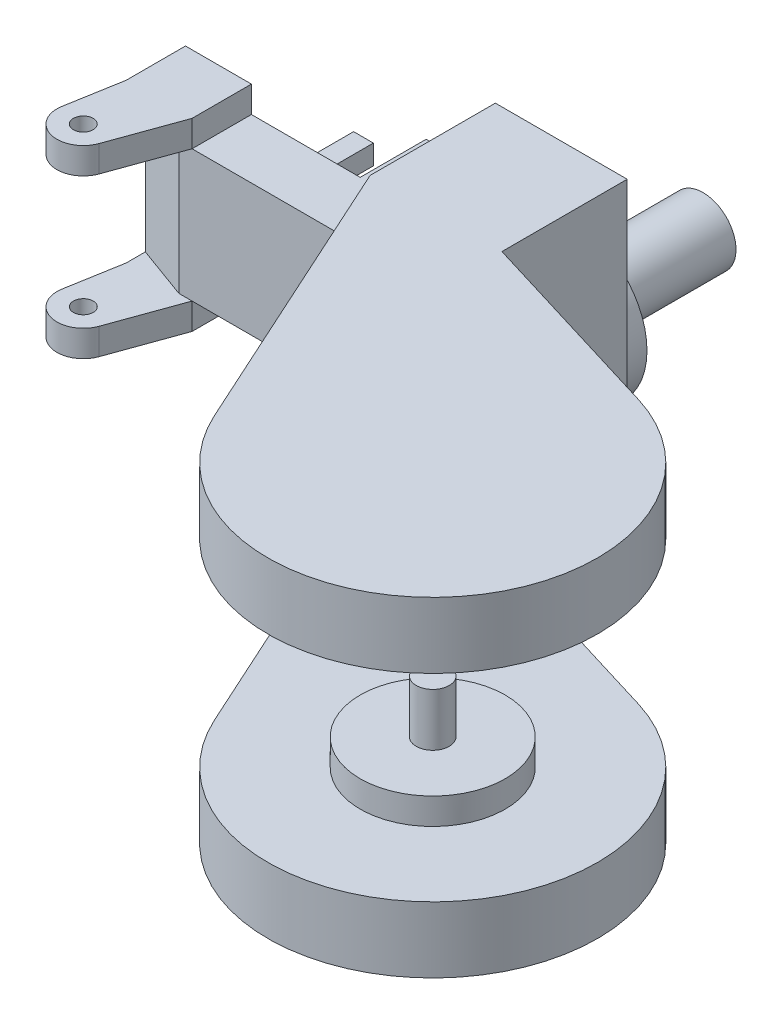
ISO-10303-21;
HEADER;
FILE_DESCRIPTION(('STEP AP214'),'2;1');
FILE_NAME('part.step','',(''),(''),'','','');
FILE_SCHEMA(('AUTOMOTIVE_DESIGN { 1 0 10303 214 1 1 1 1 }'));
ENDSEC;
DATA;
#1=APPLICATION_CONTEXT('core data for automotive mechanical design processes');
#2=APPLICATION_PROTOCOL_DEFINITION('international standard','automotive_design',2000,#1);
#3=PRODUCT_CONTEXT('',#1,'mechanical');
#4=PRODUCT('Part','Part','',(#3));
#5=PRODUCT_RELATED_PRODUCT_CATEGORY('part','',(#4));
#6=PRODUCT_DEFINITION_FORMATION('','',#4);
#7=PRODUCT_DEFINITION_CONTEXT('part definition',#1,'design');
#8=PRODUCT_DEFINITION('design','',#6,#7);
#9=PRODUCT_DEFINITION_SHAPE('','',#8);
#10=(LENGTH_UNIT() NAMED_UNIT(*) SI_UNIT(.MILLI.,.METRE.));
#11=(NAMED_UNIT(*) PLANE_ANGLE_UNIT() SI_UNIT($,.RADIAN.));
#12=(NAMED_UNIT(*) SI_UNIT($,.STERADIAN.) SOLID_ANGLE_UNIT());
#13=UNCERTAINTY_MEASURE_WITH_UNIT(LENGTH_MEASURE(1.E-05),#10,'distance_accuracy_value','');
#14=(GEOMETRIC_REPRESENTATION_CONTEXT(3) GLOBAL_UNCERTAINTY_ASSIGNED_CONTEXT((#13)) GLOBAL_UNIT_ASSIGNED_CONTEXT((#10,
#11,#12)) REPRESENTATION_CONTEXT('',''));
#15=CARTESIAN_POINT('',(0.,0.,0.));
#16=DIRECTION('',(0.,0.,1.));
#17=DIRECTION('',(1.,0.,0.));
#18=AXIS2_PLACEMENT_3D('',#15,#16,#17);
#19=CARTESIAN_POINT('',(-180.,150.,350.));
#20=DIRECTION('',(0.,0.,-1.));
#21=DIRECTION('',(-1.,0.,0.));
#22=AXIS2_PLACEMENT_3D('',#19,#20,#21);
#23=PLANE('',#22);
#24=DIRECTION('',(0.,1.,0.));
#25=VECTOR('',#24,1.);
#26=CARTESIAN_POINT('',(-445.,-50.,350.));
#27=LINE('',#26,#25);
#28=CARTESIAN_POINT('',(-445.,-90.,350.));
#29=VERTEX_POINT('',#28);
#30=CARTESIAN_POINT('',(-445.,190.,350.));
#31=VERTEX_POINT('',#30);
#32=EDGE_CURVE('E240',#29,#31,#27,.T.);
#33=ORIENTED_EDGE('',*,*,#32,.T.);
#34=DIRECTION('',(-1.,0.,0.));
#35=VECTOR('',#34,1.);
#36=CARTESIAN_POINT('',(-345.,190.,350.));
#37=LINE('',#36,#35);
#38=CARTESIAN_POINT('',(-345.,190.,350.));
#39=VERTEX_POINT('',#38);
#40=EDGE_CURVE('E164',#39,#31,#37,.T.);
#41=ORIENTED_EDGE('',*,*,#40,.F.);
#42=DIRECTION('',(0.,-1.,0.));
#43=VECTOR('',#42,1.);
#44=CARTESIAN_POINT('',(-345.,190.,350.));
#45=LINE('',#44,#43);
#46=CARTESIAN_POINT('',(-345.,150.,350.));
#47=VERTEX_POINT('',#46);
#48=EDGE_CURVE('E155',#39,#47,#45,.T.);
#49=ORIENTED_EDGE('',*,*,#48,.T.);
#50=DIRECTION('',(1.,0.,0.));
#51=VECTOR('',#50,1.);
#52=CARTESIAN_POINT('',(-445.,150.,350.));
#53=LINE('',#52,#51);
#54=CARTESIAN_POINT('',(-180.,150.,350.));
#55=VERTEX_POINT('',#54);
#56=EDGE_CURVE('E166',#47,#55,#53,.T.);
#57=ORIENTED_EDGE('',*,*,#56,.T.);
#58=DIRECTION('',(0.,-1.,0.));
#59=VECTOR('',#58,1.);
#60=CARTESIAN_POINT('',(-180.,150.,350.));
#61=LINE('',#60,#59);
#62=CARTESIAN_POINT('',(-180.,-50.,350.));
#63=VERTEX_POINT('',#62);
#64=EDGE_CURVE('E245',#55,#63,#61,.T.);
#65=ORIENTED_EDGE('',*,*,#64,.T.);
#66=DIRECTION('',(-1.,0.,0.));
#67=VECTOR('',#66,1.);
#68=CARTESIAN_POINT('',(-180.,-50.,350.));
#69=LINE('',#68,#67);
#70=CARTESIAN_POINT('',(-345.,-50.,350.));
#71=VERTEX_POINT('',#70);
#72=EDGE_CURVE('E248',#63,#71,#69,.T.);
#73=ORIENTED_EDGE('',*,*,#72,.T.);
#74=DIRECTION('',(0.,1.,0.));
#75=VECTOR('',#74,1.);
#76=CARTESIAN_POINT('',(-345.,-90.,350.));
#77=LINE('',#76,#75);
#78=CARTESIAN_POINT('',(-345.,-90.,350.));
#79=VERTEX_POINT('',#78);
#80=EDGE_CURVE('E230',#79,#71,#77,.T.);
#81=ORIENTED_EDGE('',*,*,#80,.F.);
#82=DIRECTION('',(1.,0.,0.));
#83=VECTOR('',#82,1.);
#84=CARTESIAN_POINT('',(-445.,-90.,350.));
#85=LINE('',#84,#83);
#86=EDGE_CURVE('E193',#29,#79,#85,.T.);
#87=ORIENTED_EDGE('',*,*,#86,.F.);
#88=EDGE_LOOP('',(#33,#41,#49,#57,#65,#73,#81,#87));
#89=FACE_BOUND('',#88,.T.);
#90=DIRECTION('',(1.,0.,0.));
#91=VECTOR('',#90,1.);
#92=CARTESIAN_POINT('',(-330.,55.,350.));
#93=LINE('',#92,#91);
#94=CARTESIAN_POINT('',(-340.,55.,350.));
#95=VERTEX_POINT('',#94);
#96=CARTESIAN_POINT('',(-310.,55.,350.));
#97=VERTEX_POINT('',#96);
#98=EDGE_CURVE('E112',#95,#97,#93,.T.);
#99=ORIENTED_EDGE('',*,*,#98,.F.);
#100=DIRECTION('',(0.,1.,0.));
#101=VECTOR('',#100,1.);
#102=CARTESIAN_POINT('',(-340.,65.,350.));
#103=LINE('',#102,#101);
#104=CARTESIAN_POINT('',(-340.,25.,350.));
#105=VERTEX_POINT('',#104);
#106=EDGE_CURVE('E110',#105,#95,#103,.T.);
#107=ORIENTED_EDGE('',*,*,#106,.F.);
#108=DIRECTION('',(-1.,0.,0.));
#109=VECTOR('',#108,1.);
#110=CARTESIAN_POINT('',(-330.,25.,350.));
#111=LINE('',#110,#109);
#112=CARTESIAN_POINT('',(-310.,25.,350.));
#113=VERTEX_POINT('',#112);
#114=EDGE_CURVE('E108',#113,#105,#111,.T.);
#115=ORIENTED_EDGE('',*,*,#114,.F.);
#116=DIRECTION('',(0.,-1.,0.));
#117=VECTOR('',#116,1.);
#118=CARTESIAN_POINT('',(-310.,65.,350.));
#119=LINE('',#118,#117);
#120=EDGE_CURVE('E97',#97,#113,#119,.T.);
#121=ORIENTED_EDGE('',*,*,#120,.F.);
#122=EDGE_LOOP('',(#99,#107,#115,#121));
#123=FACE_BOUND('',#122,.T.);
#124=ADVANCED_FACE('F34',(#89,#123),#23,.T.);
#125=CARTESIAN_POINT('',(0.,0.,210.));
#126=DIRECTION('',(0.,0.,-1.));
#127=DIRECTION('',(0.,1.,0.));
#128=AXIS2_PLACEMENT_3D('',#125,#126,#127);
#129=PLANE('',#128);
#130=CARTESIAN_POINT('',(0.,0.,210.));
#131=DIRECTION('',(0.,0.,-1.));
#132=DIRECTION('',(0.,1.,0.));
#133=AXIS2_PLACEMENT_3D('',#130,#131,#132);
#134=CIRCLE('',#133,115.);
#135=CARTESIAN_POINT('',(0.,115.,210.));
#136=VERTEX_POINT('',#135);
#137=EDGE_CURVE('E1134',#136,#136,#134,.T.);
#138=ORIENTED_EDGE('',*,*,#137,.T.);
#139=EDGE_LOOP('',(#138));
#140=FACE_BOUND('',#139,.T.);
#141=CARTESIAN_POINT('',(0.,0.,210.));
#142=DIRECTION('',(0.,0.,-1.));
#143=DIRECTION('',(0.,1.,0.));
#144=AXIS2_PLACEMENT_3D('',#141,#142,#143);
#145=CIRCLE('',#144,50.);
#146=CARTESIAN_POINT('',(0.,50.,210.));
#147=VERTEX_POINT('',#146);
#148=EDGE_CURVE('E118',#147,#147,#145,.T.);
#149=ORIENTED_EDGE('',*,*,#148,.F.);
#150=EDGE_LOOP('',(#149));
#151=FACE_BOUND('',#150,.T.);
#152=ADVANCED_FACE('F645',(#140,#151),#129,.T.);
#153=CARTESIAN_POINT('',(350.,110.,770.));
#154=DIRECTION('',(0.,-1.,0.));
#155=DIRECTION('',(0.,0.,-1.));
#156=AXIS2_PLACEMENT_3D('',#153,#154,#155);
#157=PLANE('',#156);
#158=CARTESIAN_POINT('',(350.,110.,770.));
#159=DIRECTION('',(0.,-1.,0.));
#160=DIRECTION('',(0.,0.,-1.));
#161=AXIS2_PLACEMENT_3D('',#158,#159,#160);
#162=CIRCLE('',#161,110.);
#163=CARTESIAN_POINT('',(350.,110.,660.));
#164=VERTEX_POINT('',#163);
#165=EDGE_CURVE('E1131',#164,#164,#162,.T.);
#166=ORIENTED_EDGE('',*,*,#165,.T.);
#167=EDGE_LOOP('',(#166));
#168=FACE_BOUND('',#167,.T.);
#169=CARTESIAN_POINT('',(350.,110.,770.));
#170=DIRECTION('',(0.,-1.,0.));
#171=DIRECTION('',(0.,0.,-1.));
#172=AXIS2_PLACEMENT_3D('',#169,#170,#171);
#173=CIRCLE('',#172,25.);
#174=CARTESIAN_POINT('',(350.,110.,745.));
#175=VERTEX_POINT('',#174);
#176=EDGE_CURVE('E1143',#175,#175,#173,.T.);
#177=ORIENTED_EDGE('',*,*,#176,.F.);
#178=EDGE_LOOP('',(#177));
#179=FACE_BOUND('',#178,.T.);
#180=ADVANCED_FACE('F651',(#168,#179),#157,.T.);
#181=CARTESIAN_POINT('',(-180.,150.,250.));
#182=DIRECTION('',(0.,0.,1.));
#183=DIRECTION('',(1.,0.,0.));
#184=AXIS2_PLACEMENT_3D('',#181,#182,#183);
#185=PLANE('',#184);
#186=DIRECTION('',(0.,1.,0.));
#187=VECTOR('',#186,1.);
#188=CARTESIAN_POINT('',(-180.,-50.,250.));
#189=LINE('',#188,#187);
#190=CARTESIAN_POINT('',(-180.,-50.,250.));
#191=VERTEX_POINT('',#190);
#192=CARTESIAN_POINT('',(-180.,150.,250.));
#193=VERTEX_POINT('',#192);
#194=EDGE_CURVE('E239',#191,#193,#189,.T.);
#195=ORIENTED_EDGE('',*,*,#194,.T.);
#196=DIRECTION('',(1.,0.,0.));
#197=VECTOR('',#196,1.);
#198=CARTESIAN_POINT('',(125.,150.,250.));
#199=LINE('',#198,#197);
#200=CARTESIAN_POINT('',(-75.,150.,250.));
#201=VERTEX_POINT('',#200);
#202=EDGE_CURVE('E276',#193,#201,#199,.T.);
#203=ORIENTED_EDGE('',*,*,#202,.T.);
#204=DIRECTION('',(0.,-1.,0.));
#205=VECTOR('',#204,1.);
#206=CARTESIAN_POINT('',(-75.,250.,250.));
#207=LINE('',#206,#205);
#208=CARTESIAN_POINT('',(-75.,250.,250.));
#209=VERTEX_POINT('',#208);
#210=EDGE_CURVE('E568',#209,#201,#207,.T.);
#211=ORIENTED_EDGE('',*,*,#210,.F.);
#212=DIRECTION('',(-1.,0.,0.));
#213=VECTOR('',#212,1.);
#214=CARTESIAN_POINT('',(125.,250.,250.));
#215=LINE('',#214,#213);
#216=CARTESIAN_POINT('',(125.,250.,250.));
#217=VERTEX_POINT('',#216);
#218=EDGE_CURVE('E553',#217,#209,#215,.T.);
#219=ORIENTED_EDGE('',*,*,#218,.F.);
#220=DIRECTION('',(0.,-1.,0.));
#221=VECTOR('',#220,1.);
#222=CARTESIAN_POINT('',(125.,150.,250.));
#223=LINE('',#222,#221);
#224=CARTESIAN_POINT('',(125.,-250.,250.));
#225=VERTEX_POINT('',#224);
#226=EDGE_CURVE('E273',#217,#225,#223,.T.);
#227=ORIENTED_EDGE('',*,*,#226,.T.);
#228=DIRECTION('',(1.,0.,0.));
#229=VECTOR('',#228,1.);
#230=CARTESIAN_POINT('',(-75.,-250.,250.));
#231=LINE('',#230,#229);
#232=CARTESIAN_POINT('',(-75.,-250.,250.));
#233=VERTEX_POINT('',#232);
#234=EDGE_CURVE('E582',#233,#225,#231,.T.);
#235=ORIENTED_EDGE('',*,*,#234,.F.);
#236=DIRECTION('',(0.,1.,0.));
#237=VECTOR('',#236,1.);
#238=CARTESIAN_POINT('',(-75.,-250.,250.));
#239=LINE('',#238,#237);
#240=CARTESIAN_POINT('',(-75.,-150.,250.));
#241=VERTEX_POINT('',#240);
#242=EDGE_CURVE('E469',#233,#241,#239,.T.);
#243=ORIENTED_EDGE('',*,*,#242,.T.);
#244=DIRECTION('',(-0.724137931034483,0.689655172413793,0.));
#245=VECTOR('',#244,1.);
#246=CARTESIAN_POINT('',(-75.,-150.,250.));
#247=LINE('',#246,#245);
#248=EDGE_CURVE('E268',#241,#191,#247,.T.);
#249=ORIENTED_EDGE('',*,*,#248,.T.);
#250=EDGE_LOOP('',(#195,#203,#211,#219,#227,#235,#243,#249));
#251=FACE_BOUND('',#250,.T.);
#252=CARTESIAN_POINT('',(0.,0.,250.));
#253=DIRECTION('',(0.,0.,1.));
#254=DIRECTION('',(1.,0.,0.));
#255=AXIS2_PLACEMENT_3D('',#252,#253,#254);
#256=CIRCLE('',#255,115.);
#257=CARTESIAN_POINT('',(115.,0.,250.));
#258=VERTEX_POINT('',#257);
#259=EDGE_CURVE('E143',#258,#258,#256,.F.);
#260=ORIENTED_EDGE('',*,*,#259,.F.);
#261=EDGE_LOOP('',(#260));
#262=FACE_BOUND('',#261,.T.);
#263=ADVANCED_FACE('F598',(#251,#262),#185,.F.);
#264=CARTESIAN_POINT('',(350.,150.,770.));
#265=DIRECTION('',(0.,1.,0.));
#266=DIRECTION('',(0.,0.,1.));
#267=AXIS2_PLACEMENT_3D('',#264,#265,#266);
#268=PLANE('',#267);
#269=DIRECTION('',(-1.,0.,0.));
#270=VECTOR('',#269,1.);
#271=CARTESIAN_POINT('',(-180.,150.,440.));
#272=LINE('',#271,#270);
#273=CARTESIAN_POINT('',(125.,150.,440.));
#274=VERTEX_POINT('',#273);
#275=CARTESIAN_POINT('',(-75.,150.,440.));
#276=VERTEX_POINT('',#275);
#277=EDGE_CURVE('E315',#274,#276,#272,.T.);
#278=ORIENTED_EDGE('',*,*,#277,.F.);
#279=DIRECTION('',(-0.956495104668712,0.,-0.291748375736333));
#280=VECTOR('',#279,1.);
#281=CARTESIAN_POINT('',(422.937093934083,150.,530.876223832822));
#282=LINE('',#281,#280);
#283=CARTESIAN_POINT('',(422.937093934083,150.,530.876223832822));
#284=VERTEX_POINT('',#283);
#285=EDGE_CURVE('E567',#284,#274,#282,.T.);
#286=ORIENTED_EDGE('',*,*,#285,.F.);
#287=CARTESIAN_POINT('',(350.,150.,770.));
#288=DIRECTION('',(0.,1.,0.));
#289=DIRECTION('',(0.,0.,1.));
#290=AXIS2_PLACEMENT_3D('',#287,#288,#289);
#291=CIRCLE('',#290,250.);
#292=CARTESIAN_POINT('',(122.484618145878,150.,873.618294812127));
#293=VERTEX_POINT('',#292);
#294=EDGE_CURVE('E563',#293,#284,#291,.T.);
#295=ORIENTED_EDGE('',*,*,#294,.F.);
#296=DIRECTION('',(0.414473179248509,0.,0.910061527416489));
#297=VECTOR('',#296,1.);
#298=CARTESIAN_POINT('',(-75.,150.,440.));
#299=LINE('',#298,#297);
#300=EDGE_CURVE('E613',#276,#293,#299,.T.);
#301=ORIENTED_EDGE('',*,*,#300,.F.);
#302=EDGE_LOOP('',(#278,#286,#295,#301));
#303=FACE_BOUND('',#302,.T.);
#304=CARTESIAN_POINT('',(350.,150.,770.));
#305=DIRECTION('',(0.,1.,0.));
#306=DIRECTION('',(0.,0.,1.));
#307=AXIS2_PLACEMENT_3D('',#304,#305,#306);
#308=CIRCLE('',#307,110.);
#309=CARTESIAN_POINT('',(350.,150.,880.));
#310=VERTEX_POINT('',#309);
#311=EDGE_CURVE('E146',#310,#310,#308,.F.);
#312=ORIENTED_EDGE('',*,*,#311,.F.);
#313=EDGE_LOOP('',(#312));
#314=FACE_BOUND('',#313,.T.);
#315=ADVANCED_FACE('F629',(#303,#314),#268,.F.);
#316=CARTESIAN_POINT('',(350.,-150.,770.));
#317=DIRECTION('',(0.,-1.,0.));
#318=DIRECTION('',(0.,0.,-1.));
#319=AXIS2_PLACEMENT_3D('',#316,#317,#318);
#320=PLANE('',#319);
#321=DIRECTION('',(0.956495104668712,0.,0.291748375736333));
#322=VECTOR('',#321,1.);
#323=CARTESIAN_POINT('',(125.,-150.,440.));
#324=LINE('',#323,#322);
#325=CARTESIAN_POINT('',(125.,-150.,440.));
#326=VERTEX_POINT('',#325);
#327=CARTESIAN_POINT('',(422.937093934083,-150.,530.876223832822));
#328=VERTEX_POINT('',#327);
#329=EDGE_CURVE('E452',#326,#328,#324,.T.);
#330=ORIENTED_EDGE('',*,*,#329,.F.);
#331=DIRECTION('',(-1.,0.,0.));
#332=VECTOR('',#331,1.);
#333=CARTESIAN_POINT('',(125.,-150.,440.));
#334=LINE('',#333,#332);
#335=CARTESIAN_POINT('',(-75.,-150.,440.));
#336=VERTEX_POINT('',#335);
#337=EDGE_CURVE('E283',#326,#336,#334,.T.);
#338=ORIENTED_EDGE('',*,*,#337,.T.);
#339=DIRECTION('',(-0.414473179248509,0.,-0.910061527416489));
#340=VECTOR('',#339,1.);
#341=CARTESIAN_POINT('',(122.484618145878,-150.,873.618294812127));
#342=LINE('',#341,#340);
#343=CARTESIAN_POINT('',(122.484618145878,-150.,873.618294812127));
#344=VERTEX_POINT('',#343);
#345=EDGE_CURVE('E450',#344,#336,#342,.T.);
#346=ORIENTED_EDGE('',*,*,#345,.F.);
#347=CARTESIAN_POINT('',(350.,-150.,770.));
#348=DIRECTION('',(0.,-1.,0.));
#349=DIRECTION('',(0.,0.,-1.));
#350=AXIS2_PLACEMENT_3D('',#347,#348,#349);
#351=CIRCLE('',#350,250.);
#352=EDGE_CURVE('E464',#328,#344,#351,.T.);
#353=ORIENTED_EDGE('',*,*,#352,.F.);
#354=EDGE_LOOP('',(#330,#338,#346,#353));
#355=FACE_BOUND('',#354,.T.);
#356=CARTESIAN_POINT('',(350.,-150.,770.));
#357=DIRECTION('',(0.,-1.,0.));
#358=DIRECTION('',(0.,0.,-1.));
#359=AXIS2_PLACEMENT_3D('',#356,#357,#358);
#360=CIRCLE('',#359,110.);
#361=CARTESIAN_POINT('',(350.,-150.,660.));
#362=VERTEX_POINT('',#361);
#363=EDGE_CURVE('E149',#362,#362,#360,.F.);
#364=ORIENTED_EDGE('',*,*,#363,.F.);
#365=EDGE_LOOP('',(#364));
#366=FACE_BOUND('',#365,.T.);
#367=ADVANCED_FACE('F447',(#355,#366),#320,.F.);
#368=CARTESIAN_POINT('',(125.,150.,440.));
#369=DIRECTION('',(0.,1.,0.));
#370=DIRECTION('',(0.,0.,1.));
#371=AXIS2_PLACEMENT_3D('',#368,#369,#370);
#372=PLANE('',#371);
#373=DIRECTION('',(1.,0.,0.));
#374=VECTOR('',#373,1.);
#375=CARTESIAN_POINT('',(125.,150.,440.));
#376=LINE('',#375,#374);
#377=CARTESIAN_POINT('',(-345.,150.,440.));
#378=VERTEX_POINT('',#377);
#379=EDGE_CURVE('E272',#378,#276,#376,.T.);
#380=ORIENTED_EDGE('',*,*,#379,.T.);
#381=DIRECTION('',(0.,0.,1.));
#382=VECTOR('',#381,1.);
#383=CARTESIAN_POINT('',(-75.,150.,250.));
#384=LINE('',#383,#382);
#385=EDGE_CURVE('E304',#201,#276,#384,.T.);
#386=ORIENTED_EDGE('',*,*,#385,.F.);
#387=ORIENTED_EDGE('',*,*,#202,.F.);
#388=DIRECTION('',(0.,0.,-1.));
#389=VECTOR('',#388,1.);
#390=CARTESIAN_POINT('',(-180.,150.,440.));
#391=LINE('',#390,#389);
#392=EDGE_CURVE('E254',#55,#193,#391,.T.);
#393=ORIENTED_EDGE('',*,*,#392,.F.);
#394=ORIENTED_EDGE('',*,*,#56,.F.);
#395=DIRECTION('',(0.,0.,-1.));
#396=VECTOR('',#395,1.);
#397=CARTESIAN_POINT('',(-345.,150.,440.));
#398=LINE('',#397,#396);
#399=EDGE_CURVE('E160',#378,#47,#398,.T.);
#400=ORIENTED_EDGE('',*,*,#399,.F.);
#401=EDGE_LOOP('',(#380,#386,#387,#393,#394,#400));
#402=FACE_BOUND('',#401,.T.);
#403=ADVANCED_FACE('F300',(#402),#372,.T.);
#404=CARTESIAN_POINT('',(-180.,-50.,440.));
#405=DIRECTION('',(0.,-1.,0.));
#406=DIRECTION('',(0.,0.,-1.));
#407=AXIS2_PLACEMENT_3D('',#404,#405,#406);
#408=PLANE('',#407);
#409=DIRECTION('',(-1.,0.,0.));
#410=VECTOR('',#409,1.);
#411=CARTESIAN_POINT('',(-180.,-50.,440.));
#412=LINE('',#411,#410);
#413=CARTESIAN_POINT('',(-180.,-50.,440.));
#414=VERTEX_POINT('',#413);
#415=CARTESIAN_POINT('',(-345.,-50.,440.));
#416=VERTEX_POINT('',#415);
#417=EDGE_CURVE('E236',#414,#416,#412,.T.);
#418=ORIENTED_EDGE('',*,*,#417,.T.);
#419=DIRECTION('',(0.,0.,1.));
#420=VECTOR('',#419,1.);
#421=CARTESIAN_POINT('',(-345.,-50.,350.));
#422=LINE('',#421,#420);
#423=EDGE_CURVE('E187',#71,#416,#422,.T.);
#424=ORIENTED_EDGE('',*,*,#423,.F.);
#425=ORIENTED_EDGE('',*,*,#72,.F.);
#426=DIRECTION('',(0.,0.,-1.));
#427=VECTOR('',#426,1.);
#428=CARTESIAN_POINT('',(-180.,-50.,440.));
#429=LINE('',#428,#427);
#430=EDGE_CURVE('E152',#414,#63,#429,.T.);
#431=ORIENTED_EDGE('',*,*,#430,.F.);
#432=EDGE_LOOP('',(#418,#424,#425,#431));
#433=FACE_BOUND('',#432,.T.);
#434=ADVANCED_FACE('F428',(#433),#408,.T.);
#435=CARTESIAN_POINT('',(-180.,-50.,440.));
#436=DIRECTION('',(-1.,0.,0.));
#437=DIRECTION('',(0.,-1.,0.));
#438=AXIS2_PLACEMENT_3D('',#435,#436,#437);
#439=PLANE('',#438);
#440=ORIENTED_EDGE('',*,*,#64,.F.);
#441=ORIENTED_EDGE('',*,*,#392,.T.);
#442=ORIENTED_EDGE('',*,*,#194,.F.);
#443=EDGE_CURVE('E264',#63,#191,#429,.T.);
#444=ORIENTED_EDGE('',*,*,#443,.F.);
#445=EDGE_LOOP('',(#440,#441,#442,#444));
#446=FACE_BOUND('',#445,.T.);
#447=ADVANCED_FACE('F665',(#446),#439,.T.);
#448=CARTESIAN_POINT('',(-75.,-150.,440.));
#449=DIRECTION('',(-0.689655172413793,-0.724137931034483,0.));
#450=DIRECTION('',(0.724137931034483,-0.689655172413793,0.));
#451=AXIS2_PLACEMENT_3D('',#448,#449,#450);
#452=PLANE('',#451);
#453=ORIENTED_EDGE('',*,*,#248,.F.);
#454=DIRECTION('',(0.,0.,-1.));
#455=VECTOR('',#454,1.);
#456=CARTESIAN_POINT('',(-75.,-150.,440.));
#457=LINE('',#456,#455);
#458=EDGE_CURVE('E258',#336,#241,#457,.T.);
#459=ORIENTED_EDGE('',*,*,#458,.F.);
#460=DIRECTION('',(-0.724137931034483,0.689655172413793,0.));
#461=VECTOR('',#460,1.);
#462=CARTESIAN_POINT('',(-75.,-150.,440.));
#463=LINE('',#462,#461);
#464=EDGE_CURVE('E259',#336,#414,#463,.T.);
#465=ORIENTED_EDGE('',*,*,#464,.T.);
#466=ORIENTED_EDGE('',*,*,#430,.T.);
#467=ORIENTED_EDGE('',*,*,#443,.T.);
#468=EDGE_LOOP('',(#453,#459,#465,#466,#467));
#469=FACE_BOUND('',#468,.T.);
#470=ADVANCED_FACE('F438',(#469),#452,.T.);
#471=CARTESIAN_POINT('',(125.,150.,440.));
#472=DIRECTION('',(1.,0.,0.));
#473=DIRECTION('',(0.,1.,0.));
#474=AXIS2_PLACEMENT_3D('',#471,#472,#473);
#475=PLANE('',#474);
#476=ORIENTED_EDGE('',*,*,#226,.F.);
#477=DIRECTION('',(0.,0.,-1.));
#478=VECTOR('',#477,1.);
#479=CARTESIAN_POINT('',(125.,250.,440.));
#480=LINE('',#479,#478);
#481=CARTESIAN_POINT('',(125.,250.,440.));
#482=VERTEX_POINT('',#481);
#483=EDGE_CURVE('E544',#482,#217,#480,.T.);
#484=ORIENTED_EDGE('',*,*,#483,.F.);
#485=DIRECTION('',(0.,-1.,0.));
#486=VECTOR('',#485,1.);
#487=CARTESIAN_POINT('',(125.,250.,440.));
#488=LINE('',#487,#486);
#489=EDGE_CURVE('E548',#482,#274,#488,.T.);
#490=ORIENTED_EDGE('',*,*,#489,.T.);
#491=DIRECTION('',(0.,-1.,0.));
#492=VECTOR('',#491,1.);
#493=CARTESIAN_POINT('',(125.,150.,440.));
#494=LINE('',#493,#492);
#495=EDGE_CURVE('E286',#274,#326,#494,.T.);
#496=ORIENTED_EDGE('',*,*,#495,.T.);
#497=DIRECTION('',(0.,1.,0.));
#498=VECTOR('',#497,1.);
#499=CARTESIAN_POINT('',(125.,-250.,440.));
#500=LINE('',#499,#498);
#501=CARTESIAN_POINT('',(125.,-250.,440.));
#502=VERTEX_POINT('',#501);
#503=EDGE_CURVE('E473',#502,#326,#500,.T.);
#504=ORIENTED_EDGE('',*,*,#503,.F.);
#505=DIRECTION('',(0.,0.,1.));
#506=VECTOR('',#505,1.);
#507=CARTESIAN_POINT('',(125.,-250.,250.));
#508=LINE('',#507,#506);
#509=EDGE_CURVE('E585',#225,#502,#508,.T.);
#510=ORIENTED_EDGE('',*,*,#509,.F.);
#511=EDGE_LOOP('',(#476,#484,#490,#496,#504,#510));
#512=FACE_BOUND('',#511,.T.);
#513=ADVANCED_FACE('F546',(#512),#475,.T.);
#514=CARTESIAN_POINT('',(-180.,150.,440.));
#515=DIRECTION('',(0.,0.,1.));
#516=DIRECTION('',(1.,0.,0.));
#517=AXIS2_PLACEMENT_3D('',#514,#515,#516);
#518=PLANE('',#517);
#519=CARTESIAN_POINT('',(-365.,150.,440.));
#520=VERTEX_POINT('',#519);
#521=EDGE_CURVE('E288',#520,#378,#376,.T.);
#522=ORIENTED_EDGE('',*,*,#521,.F.);
#523=DIRECTION('',(0.,-1.,0.));
#524=VECTOR('',#523,1.);
#525=CARTESIAN_POINT('',(-365.,150.,440.));
#526=LINE('',#525,#524);
#527=CARTESIAN_POINT('',(-365.,-50.,440.));
#528=VERTEX_POINT('',#527);
#529=EDGE_CURVE('E134',#520,#528,#526,.T.);
#530=ORIENTED_EDGE('',*,*,#529,.T.);
#531=DIRECTION('',(1.,0.,0.));
#532=VECTOR('',#531,1.);
#533=CARTESIAN_POINT('',(-180.,-50.,440.));
#534=LINE('',#533,#532);
#535=EDGE_CURVE('E233',#528,#416,#534,.T.);
#536=ORIENTED_EDGE('',*,*,#535,.T.);
#537=ORIENTED_EDGE('',*,*,#417,.F.);
#538=ORIENTED_EDGE('',*,*,#464,.F.);
#539=ORIENTED_EDGE('',*,*,#337,.F.);
#540=ORIENTED_EDGE('',*,*,#495,.F.);
#541=ORIENTED_EDGE('',*,*,#277,.T.);
#542=ORIENTED_EDGE('',*,*,#379,.F.);
#543=EDGE_LOOP('',(#522,#530,#536,#537,#538,#539,#540,#541,#542));
#544=FACE_BOUND('',#543,.T.);
#545=ADVANCED_FACE('F311',(#544),#518,.T.);
#546=CARTESIAN_POINT('',(-445.,-50.,440.));
#547=DIRECTION('',(-1.,0.,0.));
#548=DIRECTION('',(0.,0.,1.));
#549=AXIS2_PLACEMENT_3D('',#546,#547,#548);
#550=PLANE('',#549);
#551=DIRECTION('',(0.,1.,0.));
#552=VECTOR('',#551,1.);
#553=CARTESIAN_POINT('',(-445.,-50.,410.882381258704));
#554=LINE('',#553,#552);
#555=CARTESIAN_POINT('',(-445.,-50.,410.882381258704));
#556=VERTEX_POINT('',#555);
#557=CARTESIAN_POINT('',(-445.,150.,410.882381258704));
#558=VERTEX_POINT('',#557);
#559=EDGE_CURVE('E139',#556,#558,#554,.T.);
#560=ORIENTED_EDGE('',*,*,#559,.T.);
#561=DIRECTION('',(0.,0.,1.));
#562=VECTOR('',#561,1.);
#563=CARTESIAN_POINT('',(-445.,150.,530.));
#564=LINE('',#563,#562);
#565=CARTESIAN_POINT('',(-445.,150.,440.));
#566=VERTEX_POINT('',#565);
#567=EDGE_CURVE('E136',#558,#566,#564,.T.);
#568=ORIENTED_EDGE('',*,*,#567,.T.);
#569=DIRECTION('',(0.,-1.,0.));
#570=VECTOR('',#569,1.);
#571=CARTESIAN_POINT('',(-445.,190.,440.));
#572=LINE('',#571,#570);
#573=CARTESIAN_POINT('',(-445.,190.,440.));
#574=VERTEX_POINT('',#573);
#575=EDGE_CURVE('E180',#574,#566,#572,.T.);
#576=ORIENTED_EDGE('',*,*,#575,.F.);
#577=DIRECTION('',(0.,0.,1.));
#578=VECTOR('',#577,1.);
#579=CARTESIAN_POINT('',(-445.,190.,350.));
#580=LINE('',#579,#578);
#581=EDGE_CURVE('E485',#31,#574,#580,.T.);
#582=ORIENTED_EDGE('',*,*,#581,.F.);
#583=ORIENTED_EDGE('',*,*,#32,.F.);
#584=DIRECTION('',(0.,0.,-1.));
#585=VECTOR('',#584,1.);
#586=CARTESIAN_POINT('',(-445.,-90.,440.));
#587=LINE('',#586,#585);
#588=CARTESIAN_POINT('',(-445.,-90.,440.));
#589=VERTEX_POINT('',#588);
#590=EDGE_CURVE('E190',#589,#29,#587,.T.);
#591=ORIENTED_EDGE('',*,*,#590,.F.);
#592=DIRECTION('',(0.,1.,0.));
#593=VECTOR('',#592,1.);
#594=CARTESIAN_POINT('',(-445.,-90.,440.));
#595=LINE('',#594,#593);
#596=CARTESIAN_POINT('',(-445.,-50.,440.));
#597=VERTEX_POINT('',#596);
#598=EDGE_CURVE('E209',#589,#597,#595,.T.);
#599=ORIENTED_EDGE('',*,*,#598,.T.);
#600=DIRECTION('',(0.,0.,-1.));
#601=VECTOR('',#600,1.);
#602=CARTESIAN_POINT('',(-445.,-50.,530.));
#603=LINE('',#602,#601);
#604=EDGE_CURVE('E59',#597,#556,#603,.T.);
#605=ORIENTED_EDGE('',*,*,#604,.T.);
#606=EDGE_LOOP('',(#560,#568,#576,#582,#583,#591,#599,#605));
#607=FACE_BOUND('',#606,.T.);
#608=ADVANCED_FACE('F658',(#607),#550,.T.);
#609=CARTESIAN_POINT('',(-420.,-90.,530.));
#610=DIRECTION('',(0.,-1.,0.));
#611=DIRECTION('',(1.,0.,0.));
#612=AXIS2_PLACEMENT_3D('',#609,#610,#611);
#613=PLANE('',#612);
#614=ORIENTED_EDGE('',*,*,#590,.T.);
#615=ORIENTED_EDGE('',*,*,#86,.T.);
#616=DIRECTION('',(0.,0.,1.));
#617=VECTOR('',#616,1.);
#618=CARTESIAN_POINT('',(-345.,-90.,350.));
#619=LINE('',#618,#617);
#620=CARTESIAN_POINT('',(-345.,-90.,440.));
#621=VERTEX_POINT('',#620);
#622=EDGE_CURVE('E197',#79,#621,#619,.T.);
#623=ORIENTED_EDGE('',*,*,#622,.T.);
#624=DIRECTION('',(-0.339418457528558,0.,0.940635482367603));
#625=VECTOR('',#624,1.);
#626=CARTESIAN_POINT('',(-345.,-90.,440.));
#627=LINE('',#626,#625);
#628=CARTESIAN_POINT('',(-382.374580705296,-90.,543.576738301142));
#629=VERTEX_POINT('',#628);
#630=EDGE_CURVE('E200',#621,#629,#627,.T.);
#631=ORIENTED_EDGE('',*,*,#630,.T.);
#632=CARTESIAN_POINT('',(-420.,-90.,530.));
#633=DIRECTION('',(0.,-1.,0.));
#634=DIRECTION('',(1.,0.,0.));
#635=AXIS2_PLACEMENT_3D('',#632,#633,#634);
#636=CIRCLE('',#635,40.);
#637=CARTESIAN_POINT('',(-459.412604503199,-90.,523.170167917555));
#638=VERTEX_POINT('',#637);
#639=EDGE_CURVE('E203',#629,#638,#636,.T.);
#640=ORIENTED_EDGE('',*,*,#639,.T.);
#641=DIRECTION('',(0.170745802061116,0.,-0.985315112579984));
#642=VECTOR('',#641,1.);
#643=CARTESIAN_POINT('',(-459.412604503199,-90.,523.170167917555));
#644=LINE('',#643,#642);
#645=EDGE_CURVE('E206',#638,#589,#644,.T.);
#646=ORIENTED_EDGE('',*,*,#645,.T.);
#647=EDGE_LOOP('',(#614,#615,#623,#631,#640,#646));
#648=FACE_BOUND('',#647,.T.);
#649=CARTESIAN_POINT('',(-420.,-90.,530.));
#650=DIRECTION('',(0.,-1.,0.));
#651=DIRECTION('',(1.,0.,0.));
#652=AXIS2_PLACEMENT_3D('',#649,#650,#651);
#653=CIRCLE('',#652,15.);
#654=CARTESIAN_POINT('',(-405.,-90.,530.));
#655=VERTEX_POINT('',#654);
#656=EDGE_CURVE('E184',#655,#655,#653,.T.);
#657=ORIENTED_EDGE('',*,*,#656,.F.);
#658=EDGE_LOOP('',(#657));
#659=FACE_BOUND('',#658,.T.);
#660=ADVANCED_FACE('F661',(#648,#659),#613,.T.);
#661=CARTESIAN_POINT('',(-420.,-50.,530.));
#662=DIRECTION('',(0.,-1.,0.));
#663=DIRECTION('',(1.,0.,0.));
#664=AXIS2_PLACEMENT_3D('',#661,#662,#663);
#665=PLANE('',#664);
#666=ORIENTED_EDGE('',*,*,#535,.F.);
#667=DIRECTION('',(0.939692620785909,0.,0.342020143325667));
#668=VECTOR('',#667,1.);
#669=CARTESIAN_POINT('',(-384.640779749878,-50.,432.851340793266));
#670=LINE('',#669,#668);
#671=EDGE_CURVE('E43',#528,#556,#670,.F.);
#672=ORIENTED_EDGE('',*,*,#671,.T.);
#673=ORIENTED_EDGE('',*,*,#604,.F.);
#674=DIRECTION('',(0.170745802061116,0.,-0.985315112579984));
#675=VECTOR('',#674,1.);
#676=CARTESIAN_POINT('',(-459.412604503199,-50.,523.170167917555));
#677=LINE('',#676,#675);
#678=CARTESIAN_POINT('',(-459.412604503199,-50.,523.170167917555));
#679=VERTEX_POINT('',#678);
#680=EDGE_CURVE('E194',#679,#597,#677,.T.);
#681=ORIENTED_EDGE('',*,*,#680,.F.);
#682=CARTESIAN_POINT('',(-420.,-50.,530.));
#683=DIRECTION('',(0.,-1.,0.));
#684=DIRECTION('',(1.,0.,0.));
#685=AXIS2_PLACEMENT_3D('',#682,#683,#684);
#686=CIRCLE('',#685,40.);
#687=CARTESIAN_POINT('',(-382.374580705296,-50.,543.576738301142));
#688=VERTEX_POINT('',#687);
#689=EDGE_CURVE('E215',#688,#679,#686,.T.);
#690=ORIENTED_EDGE('',*,*,#689,.F.);
#691=DIRECTION('',(-0.339418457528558,0.,0.940635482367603));
#692=VECTOR('',#691,1.);
#693=CARTESIAN_POINT('',(-345.,-50.,440.));
#694=LINE('',#693,#692);
#695=EDGE_CURVE('E212',#416,#688,#694,.T.);
#696=ORIENTED_EDGE('',*,*,#695,.F.);
#697=EDGE_LOOP('',(#666,#672,#673,#681,#690,#696));
#698=FACE_BOUND('',#697,.T.);
#699=CARTESIAN_POINT('',(-420.,-50.,530.));
#700=DIRECTION('',(0.,-1.,0.));
#701=DIRECTION('',(1.,0.,0.));
#702=AXIS2_PLACEMENT_3D('',#699,#700,#701);
#703=CIRCLE('',#702,15.);
#704=CARTESIAN_POINT('',(-405.,-50.,530.));
#705=VERTEX_POINT('',#704);
#706=EDGE_CURVE('E183',#705,#705,#703,.T.);
#707=ORIENTED_EDGE('',*,*,#706,.T.);
#708=EDGE_LOOP('',(#707));
#709=FACE_BOUND('',#708,.T.);
#710=ADVANCED_FACE('F420',(#698,#709),#665,.F.);
#711=CARTESIAN_POINT('',(-345.,-90.,350.));
#712=DIRECTION('',(-1.,0.,0.));
#713=DIRECTION('',(0.,-1.,0.));
#714=AXIS2_PLACEMENT_3D('',#711,#712,#713);
#715=PLANE('',#714);
#716=ORIENTED_EDGE('',*,*,#423,.T.);
#717=DIRECTION('',(0.,1.,0.));
#718=VECTOR('',#717,1.);
#719=CARTESIAN_POINT('',(-345.,-90.,440.));
#720=LINE('',#719,#718);
#721=EDGE_CURVE('E227',#621,#416,#720,.T.);
#722=ORIENTED_EDGE('',*,*,#721,.F.);
#723=ORIENTED_EDGE('',*,*,#622,.F.);
#724=ORIENTED_EDGE('',*,*,#80,.T.);
#725=EDGE_LOOP('',(#716,#722,#723,#724));
#726=FACE_BOUND('',#725,.T.);
#727=ADVANCED_FACE('F656',(#726),#715,.F.);
#728=CARTESIAN_POINT('',(-345.,-90.,440.));
#729=DIRECTION('',(-0.940635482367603,0.,-0.339418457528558));
#730=DIRECTION('',(-0.339418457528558,0.,0.940635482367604));
#731=AXIS2_PLACEMENT_3D('',#728,#729,#730);
#732=PLANE('',#731);
#733=ORIENTED_EDGE('',*,*,#695,.T.);
#734=DIRECTION('',(0.,1.,0.));
#735=VECTOR('',#734,1.);
#736=CARTESIAN_POINT('',(-382.374580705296,-90.,543.576738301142));
#737=LINE('',#736,#735);
#738=EDGE_CURVE('E224',#629,#688,#737,.T.);
#739=ORIENTED_EDGE('',*,*,#738,.F.);
#740=ORIENTED_EDGE('',*,*,#630,.F.);
#741=ORIENTED_EDGE('',*,*,#721,.T.);
#742=EDGE_LOOP('',(#733,#739,#740,#741));
#743=FACE_BOUND('',#742,.T.);
#744=ADVANCED_FACE('F786',(#743),#732,.F.);
#745=CARTESIAN_POINT('',(-420.,-90.,530.));
#746=DIRECTION('',(0.,1.,0.));
#747=DIRECTION('',(-1.,0.,0.));
#748=AXIS2_PLACEMENT_3D('',#745,#746,#747);
#749=CYLINDRICAL_SURFACE('',#748,40.);
#750=ORIENTED_EDGE('',*,*,#689,.T.);
#751=DIRECTION('',(0.,1.,0.));
#752=VECTOR('',#751,1.);
#753=CARTESIAN_POINT('',(-459.412604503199,-90.,523.170167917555));
#754=LINE('',#753,#752);
#755=EDGE_CURVE('E221',#638,#679,#754,.T.);
#756=ORIENTED_EDGE('',*,*,#755,.F.);
#757=ORIENTED_EDGE('',*,*,#639,.F.);
#758=ORIENTED_EDGE('',*,*,#738,.T.);
#759=EDGE_LOOP('',(#750,#756,#757,#758));
#760=FACE_BOUND('',#759,.T.);
#761=ADVANCED_FACE('F783',(#760),#749,.T.);
#762=CARTESIAN_POINT('',(-459.412604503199,-90.,523.170167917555));
#763=DIRECTION('',(0.985315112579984,0.,0.170745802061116));
#764=DIRECTION('',(0.170745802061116,0.,-0.985315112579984));
#765=AXIS2_PLACEMENT_3D('',#762,#763,#764);
#766=PLANE('',#765);
#767=ORIENTED_EDGE('',*,*,#680,.T.);
#768=ORIENTED_EDGE('',*,*,#598,.F.);
#769=ORIENTED_EDGE('',*,*,#645,.F.);
#770=ORIENTED_EDGE('',*,*,#755,.T.);
#771=EDGE_LOOP('',(#767,#768,#769,#770));
#772=FACE_BOUND('',#771,.T.);
#773=ADVANCED_FACE('F774',(#772),#766,.F.);
#774=CARTESIAN_POINT('',(-420.,-90.,530.));
#775=DIRECTION('',(0.,1.,0.));
#776=DIRECTION('',(-1.,0.,0.));
#777=AXIS2_PLACEMENT_3D('',#774,#775,#776);
#778=CYLINDRICAL_SURFACE('',#777,15.);
#779=ORIENTED_EDGE('',*,*,#656,.T.);
#780=EDGE_LOOP('',(#779));
#781=FACE_BOUND('',#780,.T.);
#782=ORIENTED_EDGE('',*,*,#706,.F.);
#783=EDGE_LOOP('',(#782));
#784=FACE_BOUND('',#783,.T.);
#785=ADVANCED_FACE('F762',(#781,#784),#778,.F.);
#786=CARTESIAN_POINT('',(-420.,150.,530.));
#787=DIRECTION('',(0.,1.,0.));
#788=DIRECTION('',(0.,0.,1.));
#789=AXIS2_PLACEMENT_3D('',#786,#787,#788);
#790=PLANE('',#789);
#791=CARTESIAN_POINT('',(-420.,150.,530.));
#792=DIRECTION('',(0.,1.,0.));
#793=DIRECTION('',(0.,0.,1.));
#794=AXIS2_PLACEMENT_3D('',#791,#792,#793);
#795=CIRCLE('',#794,15.);
#796=CARTESIAN_POINT('',(-420.,150.,545.));
#797=VERTEX_POINT('',#796);
#798=EDGE_CURVE('E479',#797,#797,#795,.T.);
#799=ORIENTED_EDGE('',*,*,#798,.T.);
#800=EDGE_LOOP('',(#799));
#801=FACE_BOUND('',#800,.T.);
#802=DIRECTION('',(-0.170745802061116,0.,0.985315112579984));
#803=VECTOR('',#802,1.);
#804=CARTESIAN_POINT('',(-445.,150.,440.));
#805=LINE('',#804,#803);
#806=CARTESIAN_POINT('',(-459.412604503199,150.,523.170167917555));
#807=VERTEX_POINT('',#806);
#808=EDGE_CURVE('E347',#566,#807,#805,.T.);
#809=ORIENTED_EDGE('',*,*,#808,.F.);
#810=ORIENTED_EDGE('',*,*,#567,.F.);
#811=DIRECTION('',(-0.939692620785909,0.,-0.342020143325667));
#812=VECTOR('',#811,1.);
#813=CARTESIAN_POINT('',(-384.640779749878,150.,432.851340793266));
#814=LINE('',#813,#812);
#815=EDGE_CURVE('E131',#558,#520,#814,.F.);
#816=ORIENTED_EDGE('',*,*,#815,.T.);
#817=ORIENTED_EDGE('',*,*,#521,.T.);
#818=DIRECTION('',(0.339418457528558,0.,-0.940635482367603));
#819=VECTOR('',#818,1.);
#820=CARTESIAN_POINT('',(-382.374580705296,150.,543.576738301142));
#821=LINE('',#820,#819);
#822=CARTESIAN_POINT('',(-382.374580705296,150.,543.576738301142));
#823=VERTEX_POINT('',#822);
#824=EDGE_CURVE('E165',#823,#378,#821,.T.);
#825=ORIENTED_EDGE('',*,*,#824,.F.);
#826=CARTESIAN_POINT('',(-420.,150.,530.));
#827=DIRECTION('',(0.,1.,0.));
#828=DIRECTION('',(0.,0.,1.));
#829=AXIS2_PLACEMENT_3D('',#826,#827,#828);
#830=CIRCLE('',#829,40.);
#831=EDGE_CURVE('E328',#807,#823,#830,.T.);
#832=ORIENTED_EDGE('',*,*,#831,.F.);
#833=EDGE_LOOP('',(#809,#810,#816,#817,#825,#832));
#834=FACE_BOUND('',#833,.T.);
#835=ADVANCED_FACE('F358',(#801,#834),#790,.F.);
#836=CARTESIAN_POINT('',(-420.,190.,530.));
#837=DIRECTION('',(0.,1.,0.));
#838=DIRECTION('',(0.,0.,1.));
#839=AXIS2_PLACEMENT_3D('',#836,#837,#838);
#840=PLANE('',#839);
#841=ORIENTED_EDGE('',*,*,#40,.T.);
#842=ORIENTED_EDGE('',*,*,#581,.T.);
#843=DIRECTION('',(-0.170745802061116,0.,0.985315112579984));
#844=VECTOR('',#843,1.);
#845=CARTESIAN_POINT('',(-445.,190.,440.));
#846=LINE('',#845,#844);
#847=CARTESIAN_POINT('',(-459.412604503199,190.,523.170167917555));
#848=VERTEX_POINT('',#847);
#849=EDGE_CURVE('E488',#574,#848,#846,.T.);
#850=ORIENTED_EDGE('',*,*,#849,.T.);
#851=CARTESIAN_POINT('',(-420.,190.,530.));
#852=DIRECTION('',(0.,1.,0.));
#853=DIRECTION('',(0.,0.,1.));
#854=AXIS2_PLACEMENT_3D('',#851,#852,#853);
#855=CIRCLE('',#854,40.);
#856=CARTESIAN_POINT('',(-382.374580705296,190.,543.576738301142));
#857=VERTEX_POINT('',#856);
#858=EDGE_CURVE('E343',#848,#857,#855,.T.);
#859=ORIENTED_EDGE('',*,*,#858,.T.);
#860=DIRECTION('',(0.339418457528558,0.,-0.940635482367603));
#861=VECTOR('',#860,1.);
#862=CARTESIAN_POINT('',(-382.374580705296,190.,543.576738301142));
#863=LINE('',#862,#861);
#864=CARTESIAN_POINT('',(-345.,190.,440.));
#865=VERTEX_POINT('',#864);
#866=EDGE_CURVE('E341',#857,#865,#863,.T.);
#867=ORIENTED_EDGE('',*,*,#866,.T.);
#868=DIRECTION('',(0.,0.,-1.));
#869=VECTOR('',#868,1.);
#870=CARTESIAN_POINT('',(-345.,190.,440.));
#871=LINE('',#870,#869);
#872=EDGE_CURVE('E159',#865,#39,#871,.T.);
#873=ORIENTED_EDGE('',*,*,#872,.T.);
#874=EDGE_LOOP('',(#841,#842,#850,#859,#867,#873));
#875=FACE_BOUND('',#874,.T.);
#876=CARTESIAN_POINT('',(-420.,190.,530.));
#877=DIRECTION('',(0.,1.,0.));
#878=DIRECTION('',(0.,0.,1.));
#879=AXIS2_PLACEMENT_3D('',#876,#877,#878);
#880=CIRCLE('',#879,15.);
#881=CARTESIAN_POINT('',(-420.,190.,545.));
#882=VERTEX_POINT('',#881);
#883=EDGE_CURVE('E349',#882,#882,#880,.T.);
#884=ORIENTED_EDGE('',*,*,#883,.F.);
#885=EDGE_LOOP('',(#884));
#886=FACE_BOUND('',#885,.T.);
#887=ADVANCED_FACE('F491',(#875,#886),#840,.T.);
#888=CARTESIAN_POINT('',(-445.,190.,440.));
#889=DIRECTION('',(0.985315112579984,0.,0.170745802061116));
#890=DIRECTION('',(0.170745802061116,0.,-0.985315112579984));
#891=AXIS2_PLACEMENT_3D('',#888,#889,#890);
#892=PLANE('',#891);
#893=ORIENTED_EDGE('',*,*,#808,.T.);
#894=DIRECTION('',(0.,-1.,0.));
#895=VECTOR('',#894,1.);
#896=CARTESIAN_POINT('',(-459.412604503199,190.,523.170167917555));
#897=LINE('',#896,#895);
#898=EDGE_CURVE('E177',#848,#807,#897,.T.);
#899=ORIENTED_EDGE('',*,*,#898,.F.);
#900=ORIENTED_EDGE('',*,*,#849,.F.);
#901=ORIENTED_EDGE('',*,*,#575,.T.);
#902=EDGE_LOOP('',(#893,#899,#900,#901));
#903=FACE_BOUND('',#902,.T.);
#904=ADVANCED_FACE('F759',(#903),#892,.F.);
#905=CARTESIAN_POINT('',(-420.,190.,530.));
#906=DIRECTION('',(0.,-1.,0.));
#907=DIRECTION('',(0.,0.,-1.));
#908=AXIS2_PLACEMENT_3D('',#905,#906,#907);
#909=CYLINDRICAL_SURFACE('',#908,40.);
#910=ORIENTED_EDGE('',*,*,#831,.T.);
#911=DIRECTION('',(0.,-1.,0.));
#912=VECTOR('',#911,1.);
#913=CARTESIAN_POINT('',(-382.374580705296,190.,543.576738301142));
#914=LINE('',#913,#912);
#915=EDGE_CURVE('E174',#857,#823,#914,.T.);
#916=ORIENTED_EDGE('',*,*,#915,.F.);
#917=ORIENTED_EDGE('',*,*,#858,.F.);
#918=ORIENTED_EDGE('',*,*,#898,.T.);
#919=EDGE_LOOP('',(#910,#916,#917,#918));
#920=FACE_BOUND('',#919,.T.);
#921=ADVANCED_FACE('F352',(#920),#909,.T.);
#922=CARTESIAN_POINT('',(-382.374580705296,190.,543.576738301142));
#923=DIRECTION('',(-0.940635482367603,0.,-0.339418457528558));
#924=DIRECTION('',(-0.339418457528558,0.,0.940635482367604));
#925=AXIS2_PLACEMENT_3D('',#922,#923,#924);
#926=PLANE('',#925);
#927=ORIENTED_EDGE('',*,*,#824,.T.);
#928=DIRECTION('',(0.,-1.,0.));
#929=VECTOR('',#928,1.);
#930=CARTESIAN_POINT('',(-345.,190.,440.));
#931=LINE('',#930,#929);
#932=EDGE_CURVE('E158',#865,#378,#931,.T.);
#933=ORIENTED_EDGE('',*,*,#932,.F.);
#934=ORIENTED_EDGE('',*,*,#866,.F.);
#935=ORIENTED_EDGE('',*,*,#915,.T.);
#936=EDGE_LOOP('',(#927,#933,#934,#935));
#937=FACE_BOUND('',#936,.T.);
#938=ADVANCED_FACE('F321',(#937),#926,.F.);
#939=CARTESIAN_POINT('',(-345.,190.,440.));
#940=DIRECTION('',(-1.,0.,0.));
#941=DIRECTION('',(0.,0.,1.));
#942=AXIS2_PLACEMENT_3D('',#939,#940,#941);
#943=PLANE('',#942);
#944=ORIENTED_EDGE('',*,*,#399,.T.);
#945=ORIENTED_EDGE('',*,*,#48,.F.);
#946=ORIENTED_EDGE('',*,*,#872,.F.);
#947=ORIENTED_EDGE('',*,*,#932,.T.);
#948=EDGE_LOOP('',(#944,#945,#946,#947));
#949=FACE_BOUND('',#948,.T.);
#950=ADVANCED_FACE('F330',(#949),#943,.F.);
#951=CARTESIAN_POINT('',(-420.,190.,530.));
#952=DIRECTION('',(0.,-1.,0.));
#953=DIRECTION('',(0.,0.,-1.));
#954=AXIS2_PLACEMENT_3D('',#951,#952,#953);
#955=CYLINDRICAL_SURFACE('',#954,15.);
#956=ORIENTED_EDGE('',*,*,#883,.T.);
#957=EDGE_LOOP('',(#956));
#958=FACE_BOUND('',#957,.T.);
#959=ORIENTED_EDGE('',*,*,#798,.F.);
#960=EDGE_LOOP('',(#959));
#961=FACE_BOUND('',#960,.T.);
#962=ADVANCED_FACE('F753',(#958,#961),#955,.F.);
#963=CARTESIAN_POINT('',(125.,-250.,440.));
#964=DIRECTION('',(-0.291748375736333,0.,0.956495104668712));
#965=DIRECTION('',(0.956495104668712,0.,0.291748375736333));
#966=AXIS2_PLACEMENT_3D('',#963,#964,#965);
#967=PLANE('',#966);
#968=ORIENTED_EDGE('',*,*,#329,.T.);
#969=DIRECTION('',(0.,1.,0.));
#970=VECTOR('',#969,1.);
#971=CARTESIAN_POINT('',(422.937093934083,-250.,530.876223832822));
#972=LINE('',#971,#970);
#973=CARTESIAN_POINT('',(422.937093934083,-250.,530.876223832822));
#974=VERTEX_POINT('',#973);
#975=EDGE_CURVE('E471',#974,#328,#972,.T.);
#976=ORIENTED_EDGE('',*,*,#975,.F.);
#977=DIRECTION('',(0.956495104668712,0.,0.291748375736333));
#978=VECTOR('',#977,1.);
#979=CARTESIAN_POINT('',(125.,-250.,440.));
#980=LINE('',#979,#978);
#981=EDGE_CURVE('E463',#502,#974,#980,.T.);
#982=ORIENTED_EDGE('',*,*,#981,.F.);
#983=ORIENTED_EDGE('',*,*,#503,.T.);
#984=EDGE_LOOP('',(#968,#976,#982,#983));
#985=FACE_BOUND('',#984,.T.);
#986=ADVANCED_FACE('F592',(#985),#967,.F.);
#987=CARTESIAN_POINT('',(350.,-250.,770.));
#988=DIRECTION('',(0.,1.,0.));
#989=DIRECTION('',(0.,0.,1.));
#990=AXIS2_PLACEMENT_3D('',#987,#988,#989);
#991=CYLINDRICAL_SURFACE('',#990,250.);
#992=ORIENTED_EDGE('',*,*,#352,.T.);
#993=DIRECTION('',(0.,1.,0.));
#994=VECTOR('',#993,1.);
#995=CARTESIAN_POINT('',(122.484618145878,-250.,873.618294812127));
#996=LINE('',#995,#994);
#997=CARTESIAN_POINT('',(122.484618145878,-250.,873.618294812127));
#998=VERTEX_POINT('',#997);
#999=EDGE_CURVE('E462',#998,#344,#996,.T.);
#1000=ORIENTED_EDGE('',*,*,#999,.F.);
#1001=CARTESIAN_POINT('',(350.,-250.,770.));
#1002=DIRECTION('',(0.,-1.,0.));
#1003=DIRECTION('',(0.,0.,-1.));
#1004=AXIS2_PLACEMENT_3D('',#1001,#1002,#1003);
#1005=CIRCLE('',#1004,250.);
#1006=EDGE_CURVE('E577',#974,#998,#1005,.T.);
#1007=ORIENTED_EDGE('',*,*,#1006,.F.);
#1008=ORIENTED_EDGE('',*,*,#975,.T.);
#1009=EDGE_LOOP('',(#992,#1000,#1007,#1008));
#1010=FACE_BOUND('',#1009,.T.);
#1011=ADVANCED_FACE('F747',(#1010),#991,.T.);
#1012=CARTESIAN_POINT('',(122.484618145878,-250.,873.618294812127));
#1013=DIRECTION('',(0.910061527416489,0.,-0.414473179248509));
#1014=DIRECTION('',(-0.414473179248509,0.,-0.910061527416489));
#1015=AXIS2_PLACEMENT_3D('',#1012,#1013,#1014);
#1016=PLANE('',#1015);
#1017=ORIENTED_EDGE('',*,*,#345,.T.);
#1018=DIRECTION('',(0.,1.,0.));
#1019=VECTOR('',#1018,1.);
#1020=CARTESIAN_POINT('',(-75.,-250.,440.));
#1021=LINE('',#1020,#1019);
#1022=CARTESIAN_POINT('',(-75.,-250.,440.));
#1023=VERTEX_POINT('',#1022);
#1024=EDGE_CURVE('E459',#1023,#336,#1021,.T.);
#1025=ORIENTED_EDGE('',*,*,#1024,.F.);
#1026=DIRECTION('',(-0.414473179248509,0.,-0.910061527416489));
#1027=VECTOR('',#1026,1.);
#1028=CARTESIAN_POINT('',(122.484618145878,-250.,873.618294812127));
#1029=LINE('',#1028,#1027);
#1030=EDGE_CURVE('E579',#998,#1023,#1029,.T.);
#1031=ORIENTED_EDGE('',*,*,#1030,.F.);
#1032=ORIENTED_EDGE('',*,*,#999,.T.);
#1033=EDGE_LOOP('',(#1017,#1025,#1031,#1032));
#1034=FACE_BOUND('',#1033,.T.);
#1035=ADVANCED_FACE('F456',(#1034),#1016,.F.);
#1036=CARTESIAN_POINT('',(-75.,-250.,440.));
#1037=DIRECTION('',(1.,0.,0.));
#1038=DIRECTION('',(0.,1.,0.));
#1039=AXIS2_PLACEMENT_3D('',#1036,#1037,#1038);
#1040=PLANE('',#1039);
#1041=ORIENTED_EDGE('',*,*,#458,.T.);
#1042=ORIENTED_EDGE('',*,*,#242,.F.);
#1043=DIRECTION('',(0.,0.,-1.));
#1044=VECTOR('',#1043,1.);
#1045=CARTESIAN_POINT('',(-75.,-250.,440.));
#1046=LINE('',#1045,#1044);
#1047=EDGE_CURVE('E468',#1023,#233,#1046,.T.);
#1048=ORIENTED_EDGE('',*,*,#1047,.F.);
#1049=ORIENTED_EDGE('',*,*,#1024,.T.);
#1050=EDGE_LOOP('',(#1041,#1042,#1048,#1049));
#1051=FACE_BOUND('',#1050,.T.);
#1052=ADVANCED_FACE('F466',(#1051),#1040,.F.);
#1053=CARTESIAN_POINT('',(350.,-250.,770.));
#1054=DIRECTION('',(0.,-1.,0.));
#1055=DIRECTION('',(0.,0.,-1.));
#1056=AXIS2_PLACEMENT_3D('',#1053,#1054,#1055);
#1057=PLANE('',#1056);
#1058=ORIENTED_EDGE('',*,*,#981,.T.);
#1059=ORIENTED_EDGE('',*,*,#1006,.T.);
#1060=ORIENTED_EDGE('',*,*,#1030,.T.);
#1061=ORIENTED_EDGE('',*,*,#1047,.T.);
#1062=ORIENTED_EDGE('',*,*,#234,.T.);
#1063=ORIENTED_EDGE('',*,*,#509,.T.);
#1064=EDGE_LOOP('',(#1058,#1059,#1060,#1061,#1062,#1063));
#1065=FACE_BOUND('',#1064,.T.);
#1066=ADVANCED_FACE('F595',(#1065),#1057,.T.);
#1067=CARTESIAN_POINT('',(422.937093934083,250.,530.876223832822));
#1068=DIRECTION('',(-0.291748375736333,0.,0.956495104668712));
#1069=DIRECTION('',(0.956495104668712,0.,0.291748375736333));
#1070=AXIS2_PLACEMENT_3D('',#1067,#1068,#1069);
#1071=PLANE('',#1070);
#1072=ORIENTED_EDGE('',*,*,#285,.T.);
#1073=ORIENTED_EDGE('',*,*,#489,.F.);
#1074=DIRECTION('',(-0.956495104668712,0.,-0.291748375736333));
#1075=VECTOR('',#1074,1.);
#1076=CARTESIAN_POINT('',(422.937093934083,250.,530.876223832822));
#1077=LINE('',#1076,#1075);
#1078=CARTESIAN_POINT('',(422.937093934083,250.,530.876223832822));
#1079=VERTEX_POINT('',#1078);
#1080=EDGE_CURVE('E554',#1079,#482,#1077,.T.);
#1081=ORIENTED_EDGE('',*,*,#1080,.F.);
#1082=DIRECTION('',(0.,-1.,0.));
#1083=VECTOR('',#1082,1.);
#1084=CARTESIAN_POINT('',(422.937093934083,250.,530.876223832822));
#1085=LINE('',#1084,#1083);
#1086=EDGE_CURVE('E609',#1079,#284,#1085,.T.);
#1087=ORIENTED_EDGE('',*,*,#1086,.T.);
#1088=EDGE_LOOP('',(#1072,#1073,#1081,#1087));
#1089=FACE_BOUND('',#1088,.T.);
#1090=ADVANCED_FACE('F565',(#1089),#1071,.F.);
#1091=CARTESIAN_POINT('',(-75.,250.,250.));
#1092=DIRECTION('',(1.,0.,0.));
#1093=DIRECTION('',(0.,0.,-1.));
#1094=AXIS2_PLACEMENT_3D('',#1091,#1092,#1093);
#1095=PLANE('',#1094);
#1096=ORIENTED_EDGE('',*,*,#385,.T.);
#1097=DIRECTION('',(0.,-1.,0.));
#1098=VECTOR('',#1097,1.);
#1099=CARTESIAN_POINT('',(-75.,250.,440.));
#1100=LINE('',#1099,#1098);
#1101=CARTESIAN_POINT('',(-75.,250.,440.));
#1102=VERTEX_POINT('',#1101);
#1103=EDGE_CURVE('E571',#1102,#276,#1100,.T.);
#1104=ORIENTED_EDGE('',*,*,#1103,.F.);
#1105=DIRECTION('',(0.,0.,1.));
#1106=VECTOR('',#1105,1.);
#1107=CARTESIAN_POINT('',(-75.,250.,250.));
#1108=LINE('',#1107,#1106);
#1109=EDGE_CURVE('E602',#209,#1102,#1108,.T.);
#1110=ORIENTED_EDGE('',*,*,#1109,.F.);
#1111=ORIENTED_EDGE('',*,*,#210,.T.);
#1112=EDGE_LOOP('',(#1096,#1104,#1110,#1111));
#1113=FACE_BOUND('',#1112,.T.);
#1114=ADVANCED_FACE('F641',(#1113),#1095,.F.);
#1115=CARTESIAN_POINT('',(-75.,250.,440.));
#1116=DIRECTION('',(0.910061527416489,0.,-0.414473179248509));
#1117=DIRECTION('',(-0.414473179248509,0.,-0.910061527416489));
#1118=AXIS2_PLACEMENT_3D('',#1115,#1116,#1117);
#1119=PLANE('',#1118);
#1120=ORIENTED_EDGE('',*,*,#300,.T.);
#1121=DIRECTION('',(0.,-1.,0.));
#1122=VECTOR('',#1121,1.);
#1123=CARTESIAN_POINT('',(122.484618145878,250.,873.618294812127));
#1124=LINE('',#1123,#1122);
#1125=CARTESIAN_POINT('',(122.484618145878,250.,873.618294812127));
#1126=VERTEX_POINT('',#1125);
#1127=EDGE_CURVE('E617',#1126,#293,#1124,.T.);
#1128=ORIENTED_EDGE('',*,*,#1127,.F.);
#1129=DIRECTION('',(0.414473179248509,0.,0.910061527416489));
#1130=VECTOR('',#1129,1.);
#1131=CARTESIAN_POINT('',(-75.,250.,440.));
#1132=LINE('',#1131,#1130);
#1133=EDGE_CURVE('E604',#1102,#1126,#1132,.T.);
#1134=ORIENTED_EDGE('',*,*,#1133,.F.);
#1135=ORIENTED_EDGE('',*,*,#1103,.T.);
#1136=EDGE_LOOP('',(#1120,#1128,#1134,#1135));
#1137=FACE_BOUND('',#1136,.T.);
#1138=ADVANCED_FACE('F624',(#1137),#1119,.F.);
#1139=CARTESIAN_POINT('',(350.,250.,770.));
#1140=DIRECTION('',(0.,-1.,0.));
#1141=DIRECTION('',(0.,0.,-1.));
#1142=AXIS2_PLACEMENT_3D('',#1139,#1140,#1141);
#1143=CYLINDRICAL_SURFACE('',#1142,250.);
#1144=ORIENTED_EDGE('',*,*,#294,.T.);
#1145=ORIENTED_EDGE('',*,*,#1086,.F.);
#1146=CARTESIAN_POINT('',(350.,250.,770.));
#1147=DIRECTION('',(0.,1.,0.));
#1148=DIRECTION('',(0.,0.,1.));
#1149=AXIS2_PLACEMENT_3D('',#1146,#1147,#1148);
#1150=CIRCLE('',#1149,250.);
#1151=EDGE_CURVE('E559',#1126,#1079,#1150,.T.);
#1152=ORIENTED_EDGE('',*,*,#1151,.F.);
#1153=ORIENTED_EDGE('',*,*,#1127,.T.);
#1154=EDGE_LOOP('',(#1144,#1145,#1152,#1153));
#1155=FACE_BOUND('',#1154,.T.);
#1156=ADVANCED_FACE('F632',(#1155),#1143,.T.);
#1157=CARTESIAN_POINT('',(350.,250.,770.));
#1158=DIRECTION('',(0.,1.,0.));
#1159=DIRECTION('',(0.,0.,1.));
#1160=AXIS2_PLACEMENT_3D('',#1157,#1158,#1159);
#1161=PLANE('',#1160);
#1162=ORIENTED_EDGE('',*,*,#1080,.T.);
#1163=ORIENTED_EDGE('',*,*,#483,.T.);
#1164=ORIENTED_EDGE('',*,*,#218,.T.);
#1165=ORIENTED_EDGE('',*,*,#1109,.T.);
#1166=ORIENTED_EDGE('',*,*,#1133,.T.);
#1167=ORIENTED_EDGE('',*,*,#1151,.T.);
#1168=EDGE_LOOP('',(#1162,#1163,#1164,#1165,#1166,#1167));
#1169=FACE_BOUND('',#1168,.T.);
#1170=ADVANCED_FACE('F557',(#1169),#1161,.T.);
#1171=CARTESIAN_POINT('',(350.,-110.,770.));
#1172=DIRECTION('',(0.,-1.,0.));
#1173=DIRECTION('',(0.,0.,-1.));
#1174=AXIS2_PLACEMENT_3D('',#1171,#1172,#1173);
#1175=CYLINDRICAL_SURFACE('',#1174,110.);
#1176=CARTESIAN_POINT('',(350.,-110.,770.));
#1177=DIRECTION('',(0.,1.,0.));
#1178=DIRECTION('',(0.,0.,1.));
#1179=AXIS2_PLACEMENT_3D('',#1176,#1177,#1178);
#1180=CIRCLE('',#1179,110.);
#1181=CARTESIAN_POINT('',(350.,-110.,880.));
#1182=VERTEX_POINT('',#1181);
#1183=EDGE_CURVE('E611',#1182,#1182,#1180,.T.);
#1184=ORIENTED_EDGE('',*,*,#1183,.F.);
#1185=EDGE_LOOP('',(#1184));
#1186=FACE_BOUND('',#1185,.T.);
#1187=ORIENTED_EDGE('',*,*,#363,.T.);
#1188=EDGE_LOOP('',(#1187));
#1189=FACE_BOUND('',#1188,.T.);
#1190=ADVANCED_FACE('F639',(#1186,#1189),#1175,.T.);
#1191=CARTESIAN_POINT('',(350.,-110.,770.));
#1192=DIRECTION('',(0.,1.,0.));
#1193=DIRECTION('',(0.,0.,1.));
#1194=AXIS2_PLACEMENT_3D('',#1191,#1192,#1193);
#1195=PLANE('',#1194);
#1196=CARTESIAN_POINT('',(350.,-110.,770.));
#1197=DIRECTION('',(0.,1.,0.));
#1198=DIRECTION('',(0.,0.,1.));
#1199=AXIS2_PLACEMENT_3D('',#1196,#1197,#1198);
#1200=CIRCLE('',#1199,25.);
#1201=CARTESIAN_POINT('',(350.,-110.,795.));
#1202=VERTEX_POINT('',#1201);
#1203=EDGE_CURVE('E12',#1202,#1202,#1200,.T.);
#1204=ORIENTED_EDGE('',*,*,#1203,.F.);
#1205=EDGE_LOOP('',(#1204));
#1206=FACE_BOUND('',#1205,.T.);
#1207=ORIENTED_EDGE('',*,*,#1183,.T.);
#1208=EDGE_LOOP('',(#1207));
#1209=FACE_BOUND('',#1208,.T.);
#1210=ADVANCED_FACE('F726',(#1206,#1209),#1195,.T.);
#1211=CARTESIAN_POINT('',(350.,110.,770.));
#1212=DIRECTION('',(0.,1.,0.));
#1213=DIRECTION('',(0.,0.,1.));
#1214=AXIS2_PLACEMENT_3D('',#1211,#1212,#1213);
#1215=CYLINDRICAL_SURFACE('',#1214,110.);
#1216=ORIENTED_EDGE('',*,*,#165,.F.);
#1217=EDGE_LOOP('',(#1216));
#1218=FACE_BOUND('',#1217,.T.);
#1219=ORIENTED_EDGE('',*,*,#311,.T.);
#1220=EDGE_LOOP('',(#1219));
#1221=FACE_BOUND('',#1220,.T.);
#1222=ADVANCED_FACE('F719',(#1218,#1221),#1215,.T.);
#1223=CARTESIAN_POINT('',(0.,0.,210.));
#1224=DIRECTION('',(0.,0.,1.));
#1225=DIRECTION('',(0.,-1.,0.));
#1226=AXIS2_PLACEMENT_3D('',#1223,#1224,#1225);
#1227=CYLINDRICAL_SURFACE('',#1226,115.);
#1228=ORIENTED_EDGE('',*,*,#137,.F.);
#1229=EDGE_LOOP('',(#1228));
#1230=FACE_BOUND('',#1229,.T.);
#1231=ORIENTED_EDGE('',*,*,#259,.T.);
#1232=EDGE_LOOP('',(#1231));
#1233=FACE_BOUND('',#1232,.T.);
#1234=ADVANCED_FACE('F682',(#1230,#1233),#1227,.T.);
#1235=CARTESIAN_POINT('',(-445.,-50.,410.882381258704));
#1236=DIRECTION('',(0.342020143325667,0.,-0.939692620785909));
#1237=DIRECTION('',(-0.939692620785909,0.,-0.342020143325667));
#1238=AXIS2_PLACEMENT_3D('',#1235,#1236,#1237);
#1239=PLANE('',#1238);
#1240=ORIENTED_EDGE('',*,*,#671,.F.);
#1241=ORIENTED_EDGE('',*,*,#529,.F.);
#1242=ORIENTED_EDGE('',*,*,#815,.F.);
#1243=ORIENTED_EDGE('',*,*,#559,.F.);
#1244=EDGE_LOOP('',(#1240,#1241,#1242,#1243));
#1245=FACE_BOUND('',#1244,.T.);
#1246=ADVANCED_FACE('F416',(#1245),#1239,.F.);
#1247=CARTESIAN_POINT('',(350.,-30.,770.));
#1248=DIRECTION('',(0.,-1.,0.));
#1249=DIRECTION('',(0.,0.,-1.));
#1250=AXIS2_PLACEMENT_3D('',#1247,#1248,#1249);
#1251=CYLINDRICAL_SURFACE('',#1250,25.);
#1252=CARTESIAN_POINT('',(350.,-30.,770.));
#1253=DIRECTION('',(0.,-1.,0.));
#1254=DIRECTION('',(0.,0.,-1.));
#1255=AXIS2_PLACEMENT_3D('',#1252,#1253,#1254);
#1256=CIRCLE('',#1255,25.);
#1257=CARTESIAN_POINT('',(350.,-30.,745.));
#1258=VERTEX_POINT('',#1257);
#1259=EDGE_CURVE('E1139',#1258,#1258,#1256,.T.);
#1260=ORIENTED_EDGE('',*,*,#1259,.T.);
#1261=EDGE_LOOP('',(#1260));
#1262=FACE_BOUND('',#1261,.T.);
#1263=ORIENTED_EDGE('',*,*,#1203,.T.);
#1264=EDGE_LOOP('',(#1263));
#1265=FACE_BOUND('',#1264,.T.);
#1266=ADVANCED_FACE('F681',(#1262,#1265),#1251,.T.);
#1267=CARTESIAN_POINT('',(350.,-30.,770.));
#1268=DIRECTION('',(0.,-1.,0.));
#1269=DIRECTION('',(0.,0.,-1.));
#1270=AXIS2_PLACEMENT_3D('',#1267,#1268,#1269);
#1271=PLANE('',#1270);
#1272=ORIENTED_EDGE('',*,*,#1259,.F.);
#1273=EDGE_LOOP('',(#1272));
#1274=FACE_BOUND('',#1273,.T.);
#1275=ADVANCED_FACE('F709',(#1274),#1271,.F.);
#1276=CARTESIAN_POINT('',(350.,70.,770.));
#1277=DIRECTION('',(0.,1.,0.));
#1278=DIRECTION('',(0.,0.,1.));
#1279=AXIS2_PLACEMENT_3D('',#1276,#1277,#1278);
#1280=CYLINDRICAL_SURFACE('',#1279,25.);
#1281=CARTESIAN_POINT('',(350.,70.,770.));
#1282=DIRECTION('',(0.,-1.,0.));
#1283=DIRECTION('',(0.,0.,-1.));
#1284=AXIS2_PLACEMENT_3D('',#1281,#1282,#1283);
#1285=CIRCLE('',#1284,25.);
#1286=CARTESIAN_POINT('',(350.,70.,745.));
#1287=VERTEX_POINT('',#1286);
#1288=EDGE_CURVE('E1142',#1287,#1287,#1285,.T.);
#1289=ORIENTED_EDGE('',*,*,#1288,.F.);
#1290=EDGE_LOOP('',(#1289));
#1291=FACE_BOUND('',#1290,.T.);
#1292=ORIENTED_EDGE('',*,*,#176,.T.);
#1293=EDGE_LOOP('',(#1292));
#1294=FACE_BOUND('',#1293,.T.);
#1295=ADVANCED_FACE('F705',(#1291,#1294),#1280,.T.);
#1296=CARTESIAN_POINT('',(350.,70.,770.));
#1297=DIRECTION('',(0.,-1.,0.));
#1298=DIRECTION('',(0.,0.,-1.));
#1299=AXIS2_PLACEMENT_3D('',#1296,#1297,#1298);
#1300=PLANE('',#1299);
#1301=ORIENTED_EDGE('',*,*,#1288,.T.);
#1302=EDGE_LOOP('',(#1301));
#1303=FACE_BOUND('',#1302,.T.);
#1304=ADVANCED_FACE('F697',(#1303),#1300,.T.);
#1305=CARTESIAN_POINT('',(0.,0.,10.));
#1306=DIRECTION('',(0.,0.,1.));
#1307=DIRECTION('',(0.,-1.,0.));
#1308=AXIS2_PLACEMENT_3D('',#1305,#1306,#1307);
#1309=CYLINDRICAL_SURFACE('',#1308,50.);
#1310=CARTESIAN_POINT('',(0.,0.,10.));
#1311=DIRECTION('',(0.,0.,-1.));
#1312=DIRECTION('',(0.,1.,0.));
#1313=AXIS2_PLACEMENT_3D('',#1310,#1311,#1312);
#1314=CIRCLE('',#1313,50.);
#1315=CARTESIAN_POINT('',(0.,50.,10.));
#1316=VERTEX_POINT('',#1315);
#1317=EDGE_CURVE('E1146',#1316,#1316,#1314,.T.);
#1318=ORIENTED_EDGE('',*,*,#1317,.F.);
#1319=EDGE_LOOP('',(#1318));
#1320=FACE_BOUND('',#1319,.T.);
#1321=ORIENTED_EDGE('',*,*,#148,.T.);
#1322=EDGE_LOOP('',(#1321));
#1323=FACE_BOUND('',#1322,.T.);
#1324=ADVANCED_FACE('F691',(#1320,#1323),#1309,.T.);
#1325=CARTESIAN_POINT('',(0.,0.,10.));
#1326=DIRECTION('',(0.,0.,-1.));
#1327=DIRECTION('',(0.,1.,0.));
#1328=AXIS2_PLACEMENT_3D('',#1325,#1326,#1327);
#1329=PLANE('',#1328);
#1330=ORIENTED_EDGE('',*,*,#1317,.T.);
#1331=EDGE_LOOP('',(#1330));
#1332=FACE_BOUND('',#1331,.T.);
#1333=ADVANCED_FACE('F687',(#1332),#1329,.T.);
#1334=CARTESIAN_POINT('',(-340.,65.,200.));
#1335=DIRECTION('',(1.,0.,0.));
#1336=DIRECTION('',(0.,0.,-1.));
#1337=AXIS2_PLACEMENT_3D('',#1334,#1335,#1336);
#1338=PLANE('',#1337);
#1339=ORIENTED_EDGE('',*,*,#106,.T.);
#1340=DIRECTION('',(0.,0.,1.));
#1341=VECTOR('',#1340,1.);
#1342=CARTESIAN_POINT('',(-340.,55.,200.));
#1343=LINE('',#1342,#1341);
#1344=CARTESIAN_POINT('',(-340.,55.,200.));
#1345=VERTEX_POINT('',#1344);
#1346=EDGE_CURVE('E116',#1345,#95,#1343,.T.);
#1347=ORIENTED_EDGE('',*,*,#1346,.F.);
#1348=DIRECTION('',(0.,1.,0.));
#1349=VECTOR('',#1348,1.);
#1350=CARTESIAN_POINT('',(-340.,65.,200.));
#1351=LINE('',#1350,#1349);
#1352=CARTESIAN_POINT('',(-340.,25.,200.));
#1353=VERTEX_POINT('',#1352);
#1354=EDGE_CURVE('E114',#1353,#1345,#1351,.T.);
#1355=ORIENTED_EDGE('',*,*,#1354,.F.);
#1356=DIRECTION('',(0.,0.,1.));
#1357=VECTOR('',#1356,1.);
#1358=CARTESIAN_POINT('',(-340.,25.,200.));
#1359=LINE('',#1358,#1357);
#1360=EDGE_CURVE('E100',#1353,#105,#1359,.T.);
#1361=ORIENTED_EDGE('',*,*,#1360,.T.);
#1362=EDGE_LOOP('',(#1339,#1347,#1355,#1361));
#1363=FACE_BOUND('',#1362,.T.);
#1364=ADVANCED_FACE('F125',(#1363),#1338,.F.);
#1365=CARTESIAN_POINT('',(-330.,55.,200.));
#1366=DIRECTION('',(0.,-1.,0.));
#1367=DIRECTION('',(0.,0.,-1.));
#1368=AXIS2_PLACEMENT_3D('',#1365,#1366,#1367);
#1369=PLANE('',#1368);
#1370=ORIENTED_EDGE('',*,*,#98,.T.);
#1371=DIRECTION('',(0.,0.,1.));
#1372=VECTOR('',#1371,1.);
#1373=CARTESIAN_POINT('',(-310.,55.,200.));
#1374=LINE('',#1373,#1372);
#1375=CARTESIAN_POINT('',(-310.,55.,200.));
#1376=VERTEX_POINT('',#1375);
#1377=EDGE_CURVE('E99',#1376,#97,#1374,.T.);
#1378=ORIENTED_EDGE('',*,*,#1377,.F.);
#1379=DIRECTION('',(1.,0.,0.));
#1380=VECTOR('',#1379,1.);
#1381=CARTESIAN_POINT('',(-330.,55.,200.));
#1382=LINE('',#1381,#1380);
#1383=EDGE_CURVE('E92',#1345,#1376,#1382,.T.);
#1384=ORIENTED_EDGE('',*,*,#1383,.F.);
#1385=ORIENTED_EDGE('',*,*,#1346,.T.);
#1386=EDGE_LOOP('',(#1370,#1378,#1384,#1385));
#1387=FACE_BOUND('',#1386,.T.);
#1388=ADVANCED_FACE('F127',(#1387),#1369,.F.);
#1389=CARTESIAN_POINT('',(-310.,65.,200.));
#1390=DIRECTION('',(-1.,0.,0.));
#1391=DIRECTION('',(0.,0.,1.));
#1392=AXIS2_PLACEMENT_3D('',#1389,#1390,#1391);
#1393=PLANE('',#1392);
#1394=ORIENTED_EDGE('',*,*,#120,.T.);
#1395=DIRECTION('',(0.,0.,1.));
#1396=VECTOR('',#1395,1.);
#1397=CARTESIAN_POINT('',(-310.,25.,200.));
#1398=LINE('',#1397,#1396);
#1399=CARTESIAN_POINT('',(-310.,25.,200.));
#1400=VERTEX_POINT('',#1399);
#1401=EDGE_CURVE('E38',#1400,#113,#1398,.T.);
#1402=ORIENTED_EDGE('',*,*,#1401,.F.);
#1403=DIRECTION('',(0.,-1.,0.));
#1404=VECTOR('',#1403,1.);
#1405=CARTESIAN_POINT('',(-310.,65.,200.));
#1406=LINE('',#1405,#1404);
#1407=EDGE_CURVE('E87',#1376,#1400,#1406,.T.);
#1408=ORIENTED_EDGE('',*,*,#1407,.F.);
#1409=ORIENTED_EDGE('',*,*,#1377,.T.);
#1410=EDGE_LOOP('',(#1394,#1402,#1408,#1409));
#1411=FACE_BOUND('',#1410,.T.);
#1412=ADVANCED_FACE('F36',(#1411),#1393,.F.);
#1413=CARTESIAN_POINT('',(-330.,25.,200.));
#1414=DIRECTION('',(0.,1.,0.));
#1415=DIRECTION('',(-1.,0.,0.));
#1416=AXIS2_PLACEMENT_3D('',#1413,#1414,#1415);
#1417=PLANE('',#1416);
#1418=ORIENTED_EDGE('',*,*,#114,.T.);
#1419=ORIENTED_EDGE('',*,*,#1360,.F.);
#1420=DIRECTION('',(-1.,0.,0.));
#1421=VECTOR('',#1420,1.);
#1422=CARTESIAN_POINT('',(-330.,25.,200.));
#1423=LINE('',#1422,#1421);
#1424=EDGE_CURVE('E90',#1400,#1353,#1423,.T.);
#1425=ORIENTED_EDGE('',*,*,#1424,.F.);
#1426=ORIENTED_EDGE('',*,*,#1401,.T.);
#1427=EDGE_LOOP('',(#1418,#1419,#1425,#1426));
#1428=FACE_BOUND('',#1427,.T.);
#1429=ADVANCED_FACE('F101',(#1428),#1417,.F.);
#1430=CARTESIAN_POINT('',(-360.,35.,200.));
#1431=DIRECTION('',(0.,0.,-1.));
#1432=DIRECTION('',(-1.,0.,0.));
#1433=AXIS2_PLACEMENT_3D('',#1430,#1431,#1432);
#1434=PLANE('',#1433);
#1435=ORIENTED_EDGE('',*,*,#1354,.T.);
#1436=ORIENTED_EDGE('',*,*,#1383,.T.);
#1437=ORIENTED_EDGE('',*,*,#1407,.T.);
#1438=ORIENTED_EDGE('',*,*,#1424,.T.);
#1439=EDGE_LOOP('',(#1435,#1436,#1437,#1438));
#1440=FACE_BOUND('',#1439,.T.);
#1441=ADVANCED_FACE('F89',(#1440),#1434,.T.);
#1442=CLOSED_SHELL('',(#124,#152,#180,#263,#315,#367,#403,#434,#447,#470,#513,#545,#608,#660,
#710,#727,#744,#761,#773,#785,#835,#887,#904,#921,#938,#950,#962,#986,#1011,#1035,#1052,#1066,
#1090,#1114,#1138,#1156,#1170,#1190,#1210,#1222,#1234,#1246,#1266,#1275,#1295,#1304,#1324,#1333,
#1364,#1388,#1412,#1429,#1441));
#1443=MANIFOLD_SOLID_BREP('B2',#1442);
#1444=ADVANCED_BREP_SHAPE_REPRESENTATION('',(#18,#1443),#14);
#1445=SHAPE_DEFINITION_REPRESENTATION(#9,#1444);
ENDSEC;
END-ISO-10303-21;
